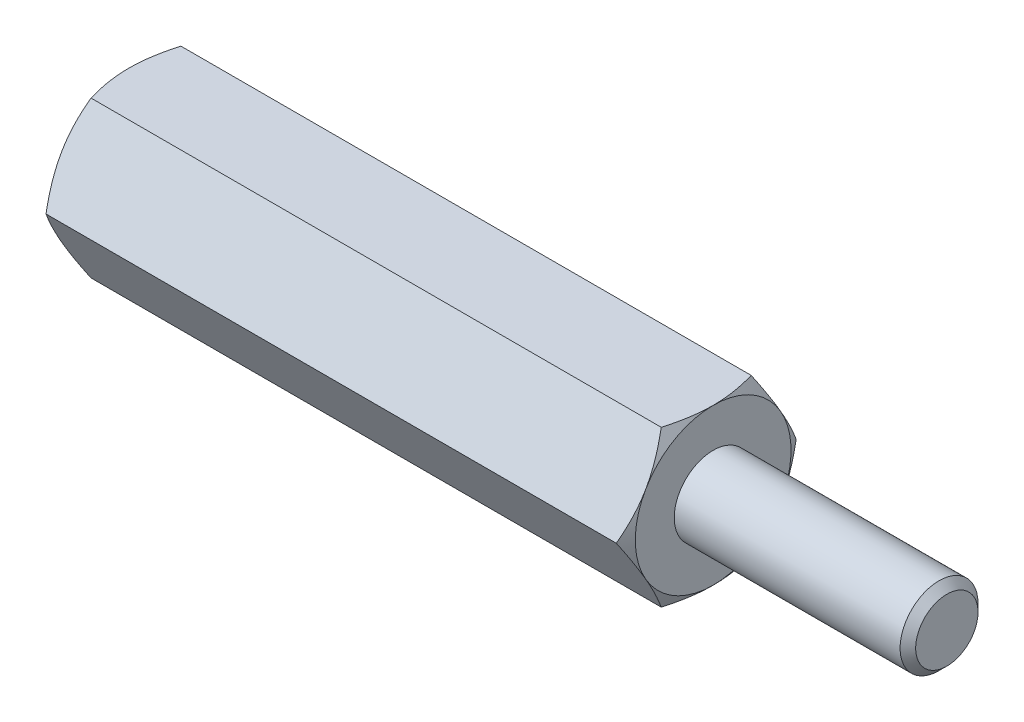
from build123d import *

# Parameters (mm, degrees)
EXTRUDE2_DEPTH = 7.5
SKETCH3_R      = 0.8
EXTRUDE3_DEPTH = 6
SKETCH5_R      = 1
EXTRUDE4_DEPTH = 6
CHAMFER1_SIZE  = 0.2


with BuildPart() as part:
    # Sketch1 → Extrude2 (new, symmetric)
    with BuildSketch(Plane(origin=(0, 0, 0), x_dir=(0, 0, -1), z_dir=(1, 0, 0))):
        Polygon((1.154700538, 2), (-1.154700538, 2), (-2.309401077, 0), (-1.154700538, -2), (1.154700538, -2), (2.309401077, 0), align=None)
    extrude(amount=EXTRUDE2_DEPTH, both=True)

    # Sketch2 → Cut-Revolve1 (revolve, cut)
    with BuildSketch(Plane.XY):
        with BuildLine():
            Line((-7.5, 2), (-6, 4.598076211))
            ThreePointArc((-6, 4.598076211), (-6.48810136, 5.776457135), (-7.5, 5))
            Line((-7.5, 5), (-7.5, 2))
        make_face()
    cut_revolve1 = revolve(axis=Axis((0, 0, 0), (1, 0, 0)), mode=Mode.SUBTRACT)

    # Mirror1: Cut-Revolve1 across plane
    add(cut_revolve1.mirror(Plane(origin=(0, 0, 0), x_dir=(0, 0, 1), z_dir=(1, 0, 0))), mode=Mode.SUBTRACT)

    # Sketch3 → Extrude3 (cut)
    with BuildSketch(Plane.ZY.offset(7.5)):
        Circle(SKETCH3_R)
    extrude(amount=-EXTRUDE3_DEPTH, mode=Mode.SUBTRACT)

    # Sketch4 → Cut-Revolve2 (revolve, cut)
    with BuildSketch(Plane.XY, mode=Mode.PRIVATE) as cut_revolve2_sk:
        Polygon((-1.5, 0), (-1.5, 0.8), (-1.038119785, 0), align=None)
    revolve(cut_revolve2_sk.sketch.rotate(Axis((-1.038119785, 0, 0), (-1, 0, 0)), 180), axis=Axis((-1.038119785, 0, 0), (-1, 0, 0)), mode=Mode.SUBTRACT)

    # Sketch5 → Extrude4 (add)
    with BuildSketch(Plane(origin=(7.5, 0, 0), x_dir=(0, 0, -1), z_dir=(1, 0, 0))):
        Circle(SKETCH5_R)
    extrude(amount=EXTRUDE4_DEPTH)

    # Chamfer1
    chamfer1_edges = [part.edges().sort_by_distance(p)[0] for p in [
        (13.5, 0, 1),
    ]]
    chamfer(chamfer1_edges, length=CHAMFER1_SIZE)


solid = part.part
